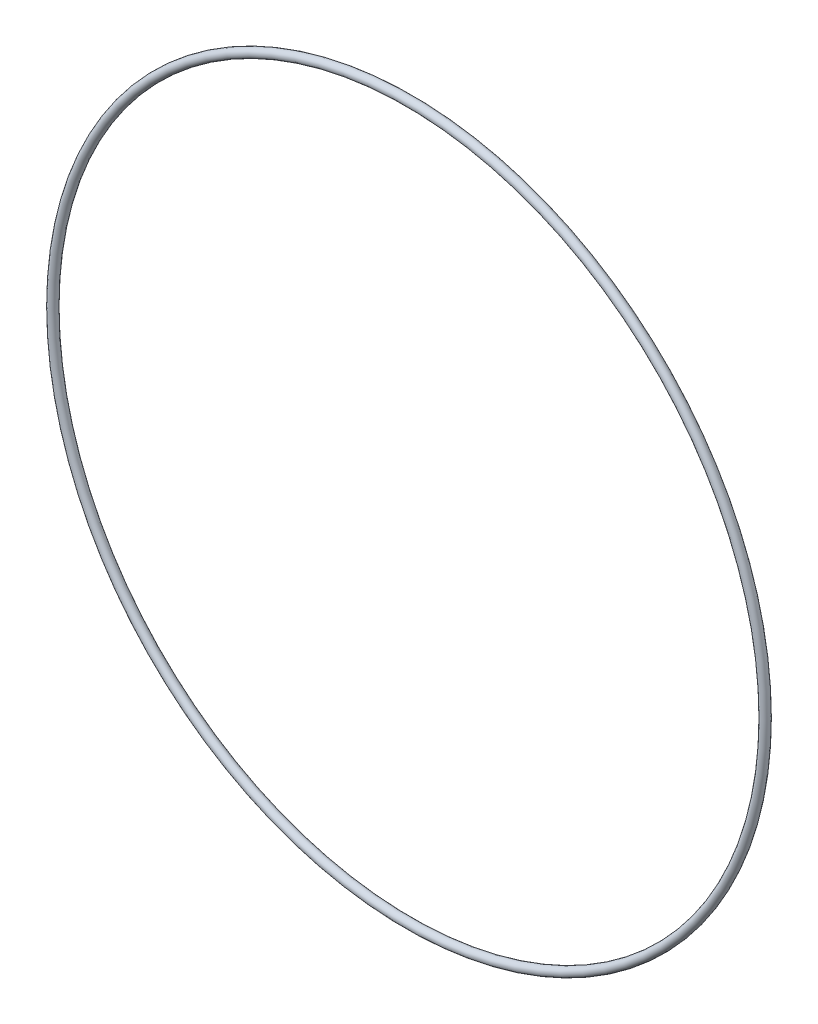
from build123d import *

# Parameters (mm, degrees)
SKETCH1_R = 1.3081


with BuildPart() as part:
    # Sketch1 → Revolve1 (revolve)
    with BuildSketch(Plane(origin=(0, 0, 0), x_dir=(0, -1, 0), z_dir=(1, 0, 0)), mode=Mode.PRIVATE) as revolve1_sk:
        with Locations((105.918, 0)):
            Circle(SKETCH1_R)
    revolve(revolve1_sk.sketch.rotate(Axis((0, 0, 1.3081), (0, 0, -1)), 270), axis=Axis((0, 0, 1.3081), (0, 0, -1)))


solid = part.part
